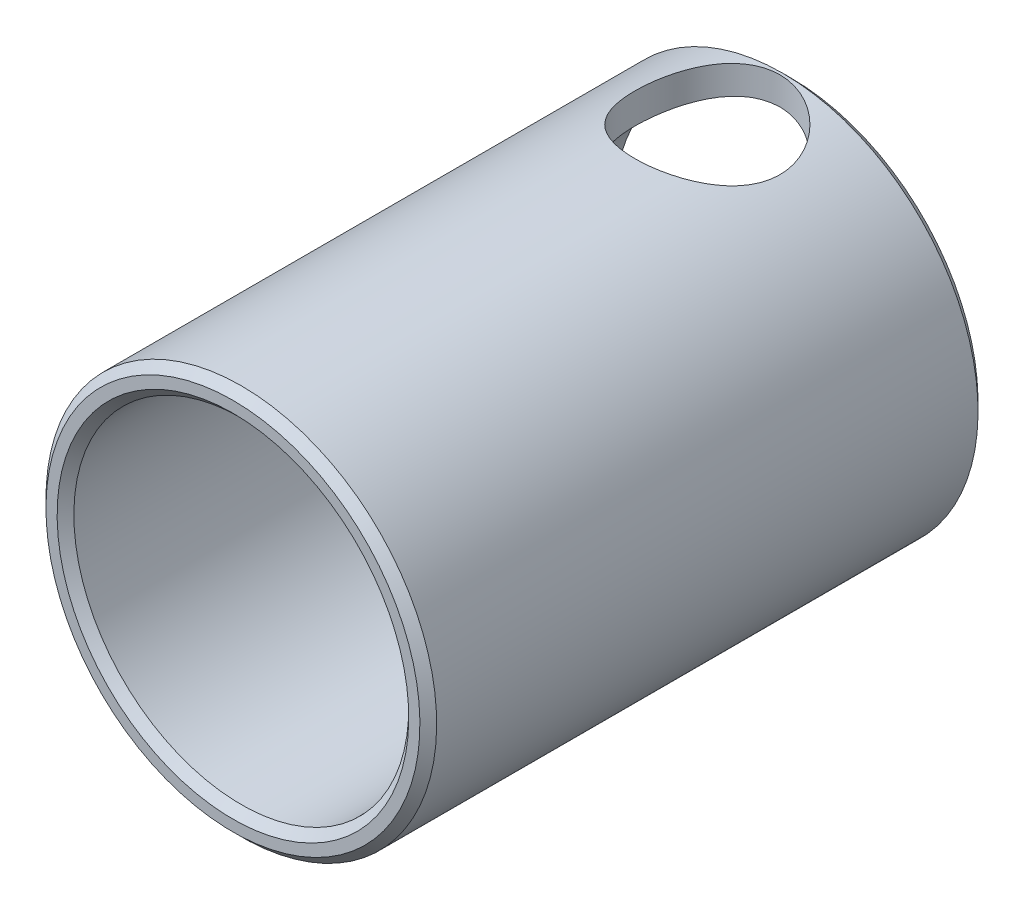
ISO-10303-21;
HEADER;
FILE_DESCRIPTION(('STEP AP214'),'2;1');
FILE_NAME('part.step','',(''),(''),'','','');
FILE_SCHEMA(('AUTOMOTIVE_DESIGN { 1 0 10303 214 1 1 1 1 }'));
ENDSEC;
DATA;
#1=APPLICATION_CONTEXT('core data for automotive mechanical design processes');
#2=APPLICATION_PROTOCOL_DEFINITION('international standard','automotive_design',2000,#1);
#3=PRODUCT_CONTEXT('',#1,'mechanical');
#4=PRODUCT('Part','Part','',(#3));
#5=PRODUCT_RELATED_PRODUCT_CATEGORY('part','',(#4));
#6=PRODUCT_DEFINITION_FORMATION('','',#4);
#7=PRODUCT_DEFINITION_CONTEXT('part definition',#1,'design');
#8=PRODUCT_DEFINITION('design','',#6,#7);
#9=PRODUCT_DEFINITION_SHAPE('','',#8);
#10=(LENGTH_UNIT() NAMED_UNIT(*) SI_UNIT(.MILLI.,.METRE.));
#11=(NAMED_UNIT(*) PLANE_ANGLE_UNIT() SI_UNIT($,.RADIAN.));
#12=(NAMED_UNIT(*) SI_UNIT($,.STERADIAN.) SOLID_ANGLE_UNIT());
#13=UNCERTAINTY_MEASURE_WITH_UNIT(LENGTH_MEASURE(1.E-05),#10,'distance_accuracy_value','');
#14=(GEOMETRIC_REPRESENTATION_CONTEXT(3) GLOBAL_UNCERTAINTY_ASSIGNED_CONTEXT((#13)) GLOBAL_UNIT_ASSIGNED_CONTEXT((#10,
#11,#12)) REPRESENTATION_CONTEXT('',''));
#15=CARTESIAN_POINT('',(0.,0.,0.));
#16=DIRECTION('',(0.,0.,1.));
#17=DIRECTION('',(1.,0.,0.));
#18=AXIS2_PLACEMENT_3D('',#15,#16,#17);
#19=CARTESIAN_POINT('',(0.,0.,20.));
#20=DIRECTION('',(0.,0.,-1.));
#21=DIRECTION('',(-1.,0.,0.));
#22=AXIS2_PLACEMENT_3D('',#19,#20,#21);
#23=CYLINDRICAL_SURFACE('',#22,7.);
#24=CARTESIAN_POINT('',(0.,0.,0.299999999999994));
#25=DIRECTION('',(0.,0.,1.));
#26=DIRECTION('',(0.,1.,0.));
#27=AXIS2_PLACEMENT_3D('',#24,#25,#26);
#28=CIRCLE('',#27,7.);
#29=CARTESIAN_POINT('',(0.,7.,0.299999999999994));
#30=VERTEX_POINT('',#29);
#31=EDGE_CURVE('E8',#30,#30,#28,.T.);
#32=ORIENTED_EDGE('',*,*,#31,.T.);
#33=EDGE_LOOP('',(#32));
#34=FACE_BOUND('',#33,.T.);
#35=CARTESIAN_POINT('',(0.,0.,19.7));
#36=DIRECTION('',(0.,0.,1.));
#37=DIRECTION('',(0.,1.,0.));
#38=AXIS2_PLACEMENT_3D('',#35,#36,#37);
#39=CIRCLE('',#38,7.);
#40=CARTESIAN_POINT('',(0.,7.,19.7));
#41=VERTEX_POINT('',#40);
#42=EDGE_CURVE('E35',#41,#41,#39,.F.);
#43=ORIENTED_EDGE('',*,*,#42,.T.);
#44=EDGE_LOOP('',(#43));
#45=FACE_BOUND('',#44,.T.);
#46=CARTESIAN_POINT('',(0.,7.,0.4));
#47=CARTESIAN_POINT('',(0.140902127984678,7.00000340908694,0.399995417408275));
#48=CARTESIAN_POINT('',(0.281772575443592,6.99570847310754,0.411489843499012));
#49=CARTESIAN_POINT('',(0.559308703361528,6.97900377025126,0.456981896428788));
#50=CARTESIAN_POINT('',(0.69597489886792,6.96659500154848,0.490976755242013));
#51=CARTESIAN_POINT('',(0.961060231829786,6.93499607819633,0.580105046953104));
#52=CARTESIAN_POINT('',(1.08949454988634,6.9158188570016,0.635198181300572));
#53=CARTESIAN_POINT('',(1.33529005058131,6.87259728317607,0.764756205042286));
#54=CARTESIAN_POINT('',(1.45264831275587,6.84855165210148,0.839226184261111));
#55=CARTESIAN_POINT('',(1.67786429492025,6.79695712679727,1.00867578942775));
#56=CARTESIAN_POINT('',(1.78519764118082,6.76931039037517,1.10432230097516));
#57=CARTESIAN_POINT('',(1.98272113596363,6.71411603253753,1.31199410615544));
#58=CARTESIAN_POINT('',(2.07290618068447,6.68656844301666,1.42402425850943));
#59=CARTESIAN_POINT('',(2.23687620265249,6.63355869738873,1.66637033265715));
#60=CARTESIAN_POINT('',(2.309925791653,6.6082123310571,1.79721167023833));
#61=CARTESIAN_POINT('',(2.43275023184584,6.56399417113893,2.07041309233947));
#62=CARTESIAN_POINT('',(2.48253417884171,6.54511984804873,2.21276864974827));
#63=CARTESIAN_POINT('',(2.5553531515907,6.51702746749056,2.49892679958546));
#64=CARTESIAN_POINT('',(2.57938744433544,6.50745015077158,2.64243866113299));
#65=CARTESIAN_POINT('',(2.60314935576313,6.49798380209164,2.93175348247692));
#66=CARTESIAN_POINT('',(2.60288677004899,6.49809086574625,3.07755549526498));
#67=CARTESIAN_POINT('',(2.57882752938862,6.50767095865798,3.35822753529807));
#68=CARTESIAN_POINT('',(2.55640932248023,6.51659539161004,3.49323790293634));
#69=CARTESIAN_POINT('',(2.49095130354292,6.54189421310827,3.75742220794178));
#70=CARTESIAN_POINT('',(2.44790844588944,6.55826970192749,3.88659528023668));
#71=CARTESIAN_POINT('',(2.34165335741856,6.59696112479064,4.13827617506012));
#72=CARTESIAN_POINT('',(2.27807915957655,6.61938237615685,4.26061427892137));
#73=CARTESIAN_POINT('',(2.13281821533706,6.6676031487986,4.49328919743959));
#74=CARTESIAN_POINT('',(2.05112529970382,6.69340381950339,4.60362190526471));
#75=CARTESIAN_POINT('',(1.86561162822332,6.74754880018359,4.81679505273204));
#76=CARTESIAN_POINT('',(1.76068817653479,6.7759487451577,4.9186640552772));
#77=CARTESIAN_POINT('',(1.5349179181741,6.83062982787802,5.10364628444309));
#78=CARTESIAN_POINT('',(1.41406876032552,6.8569106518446,5.18675673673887));
#79=CARTESIAN_POINT('',(1.15743751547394,6.90489731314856,5.3329069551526));
#80=CARTESIAN_POINT('',(1.02145960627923,6.92652907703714,5.39562891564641));
#81=CARTESIAN_POINT('',(0.739879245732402,6.96223204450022,5.49698648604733));
#82=CARTESIAN_POINT('',(0.594281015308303,6.9763065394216,5.5356325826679));
#83=CARTESIAN_POINT('',(0.305773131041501,6.99473357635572,5.58588709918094));
#84=CARTESIAN_POINT('',(0.163121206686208,6.99955613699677,5.59880404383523));
#85=CARTESIAN_POINT('',(-0.122376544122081,7.00038457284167,5.60103632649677));
#86=CARTESIAN_POINT('',(-0.265222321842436,6.99639235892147,5.59035677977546));
#87=CARTESIAN_POINT('',(-0.541435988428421,6.98035004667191,5.54669781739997));
#88=CARTESIAN_POINT('',(-0.674958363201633,6.96860812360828,5.51457074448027));
#89=CARTESIAN_POINT('',(-0.934627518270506,6.93855669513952,5.43004585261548));
#90=CARTESIAN_POINT('',(-1.06077333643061,6.92024633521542,5.37764539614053));
#91=CARTESIAN_POINT('',(-1.30622972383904,6.87820684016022,5.25239914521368));
#92=CARTESIAN_POINT('',(-1.42523360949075,6.85433523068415,5.17900159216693));
#93=CARTESIAN_POINT('',(-1.64963112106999,6.80382009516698,5.01447034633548));
#94=CARTESIAN_POINT('',(-1.75501976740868,6.77717556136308,4.9233301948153));
#95=CARTESIAN_POINT('',(-1.95546470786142,6.72217031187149,4.71979576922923));
#96=CARTESIAN_POINT('',(-2.04959193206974,6.69379820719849,4.60648723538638));
#97=CARTESIAN_POINT('',(-2.21767356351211,6.64001014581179,4.36511926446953));
#98=CARTESIAN_POINT('',(-2.29162634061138,6.61459442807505,4.23705863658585));
#99=CARTESIAN_POINT('',(-2.41728845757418,6.56971904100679,3.96887010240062));
#100=CARTESIAN_POINT('',(-2.46891958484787,6.55028038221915,3.82870179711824));
#101=CARTESIAN_POINT('',(-2.54751642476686,6.52012013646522,3.54073962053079));
#102=CARTESIAN_POINT('',(-2.57449700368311,6.50939329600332,3.39295040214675));
#103=CARTESIAN_POINT('',(-2.60171215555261,6.49856044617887,3.10398712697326));
#104=CARTESIAN_POINT('',(-2.60352712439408,6.49782691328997,2.96298416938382));
#105=CARTESIAN_POINT('',(-2.58439424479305,6.50546005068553,2.68279574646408));
#106=CARTESIAN_POINT('',(-2.56344847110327,6.51382589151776,2.54361011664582));
#107=CARTESIAN_POINT('',(-2.50061005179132,6.53819746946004,2.27515018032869));
#108=CARTESIAN_POINT('',(-2.45935063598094,6.55397162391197,2.14570484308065));
#109=CARTESIAN_POINT('',(-2.35760940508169,6.59125168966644,1.8954955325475));
#110=CARTESIAN_POINT('',(-2.29712277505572,6.61275903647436,1.77473374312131));
#111=CARTESIAN_POINT('',(-2.15501364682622,6.66046565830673,1.53853411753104));
#112=CARTESIAN_POINT('',(-2.07246017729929,6.68685000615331,1.42369421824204));
#113=CARTESIAN_POINT('',(-1.89001350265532,6.74068894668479,1.20899196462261));
#114=CARTESIAN_POINT('',(-1.7901148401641,6.76814387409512,1.10913434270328));
#115=CARTESIAN_POINT('',(-1.5695204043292,6.82276788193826,0.921872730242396));
#116=CARTESIAN_POINT('',(-1.44800627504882,6.84984571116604,0.835401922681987));
#117=CARTESIAN_POINT('',(-1.19122351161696,6.899134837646,0.684144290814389));
#118=CARTESIAN_POINT('',(-1.0559542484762,6.92134591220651,0.619358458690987));
#119=CARTESIAN_POINT('',(-0.770373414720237,6.95901970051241,0.511909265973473));
#120=CARTESIAN_POINT('',(-0.619699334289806,6.97421640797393,0.470107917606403));
#121=CARTESIAN_POINT('',(-0.312668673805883,6.99470230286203,0.414162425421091));
#122=CARTESIAN_POINT('',(-0.156314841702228,6.99999621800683,0.400005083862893));
#123=CARTESIAN_POINT('',(0.,7.,0.4));
#124=B_SPLINE_CURVE_WITH_KNOTS('',3,(#46,#47,#48,#49,#50,#51,#52,#53,#54,#55,#56,#57,#58,#59,
#60,#61,#62,#63,#64,#65,#66,#67,#68,#69,#70,#71,#72,#73,#74,#75,#76,#77,#78,#79,#80,#81,#82,#83,
#84,#85,#86,#87,#88,#89,#90,#91,#92,#93,#94,#95,#96,#97,#98,#99,#100,#101,#102,#103,#104,#105,
#106,#107,#108,#109,#110,#111,#112,#113,#114,#115,#116,#117,#118,#119,#120,#121,#122,#123),
.UNSPECIFIED.,.T.,.F.,(4,2,2,2,2,2,2,2,2,2,2,2,2,2,2,2,2,2,2,2,2,2,2,2,2,2,2,2,2,2,2,2,2,2,2,2,
2,2,4),(0.,0.42212993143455,0.844207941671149,1.26548375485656,1.68687033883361,
2.12412948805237,2.56151857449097,3.01518807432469,3.46868006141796,3.90385364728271,
4.33885178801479,4.74838765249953,5.15798401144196,5.57523654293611,5.99263136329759,
6.43750488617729,6.88244416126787,7.33401897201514,7.78539695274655,8.213164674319,
8.64083967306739,9.05245687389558,9.46412764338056,9.88780578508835,10.3116384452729,
10.7595862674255,11.2075702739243,11.6571114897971,12.1063814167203,12.5272995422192,
12.9481793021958,13.3566987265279,13.7653205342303,14.1950659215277,14.6249467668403,
15.0774737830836,15.5300215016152,15.9985502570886,16.4668552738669),.UNSPECIFIED.);
#125=CARTESIAN_POINT('',(0.,7.,0.4));
#126=VERTEX_POINT('',#125);
#127=EDGE_CURVE('E52',#126,#126,#124,.T.);
#128=ORIENTED_EDGE('',*,*,#127,.T.);
#129=EDGE_LOOP('',(#128));
#130=FACE_BOUND('',#129,.T.);
#131=ADVANCED_FACE('F12',(#34,#45,#130),#23,.T.);
#132=CARTESIAN_POINT('',(0.,0.,20.));
#133=DIRECTION('',(0.,0.,-1.));
#134=DIRECTION('',(-1.,0.,0.));
#135=AXIS2_PLACEMENT_3D('',#132,#133,#134);
#136=CYLINDRICAL_SURFACE('',#135,6.);
#137=CARTESIAN_POINT('',(0.,0.,0.300000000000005));
#138=DIRECTION('',(0.,0.,1.));
#139=DIRECTION('',(0.,1.,0.));
#140=AXIS2_PLACEMENT_3D('',#137,#138,#139);
#141=CIRCLE('',#140,6.);
#142=CARTESIAN_POINT('',(0.,6.,0.300000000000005));
#143=VERTEX_POINT('',#142);
#144=EDGE_CURVE('E19',#143,#143,#141,.F.);
#145=ORIENTED_EDGE('',*,*,#144,.T.);
#146=EDGE_LOOP('',(#145));
#147=FACE_BOUND('',#146,.T.);
#148=CARTESIAN_POINT('',(0.,0.,19.7));
#149=DIRECTION('',(0.,0.,1.));
#150=DIRECTION('',(0.,1.,0.));
#151=AXIS2_PLACEMENT_3D('',#148,#149,#150);
#152=CIRCLE('',#151,6.);
#153=CARTESIAN_POINT('',(0.,6.,19.7));
#154=VERTEX_POINT('',#153);
#155=EDGE_CURVE('E32',#154,#154,#152,.T.);
#156=ORIENTED_EDGE('',*,*,#155,.T.);
#157=EDGE_LOOP('',(#156));
#158=FACE_BOUND('',#157,.T.);
#159=CARTESIAN_POINT('',(0.,6.,0.4));
#160=CARTESIAN_POINT('',(-0.138770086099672,5.99999464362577,0.400006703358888));
#161=CARTESIAN_POINT('',(-0.277770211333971,5.99513125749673,0.411175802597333));
#162=CARTESIAN_POINT('',(-0.551789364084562,5.97616070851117,0.455420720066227));
#163=CARTESIAN_POINT('',(-0.686797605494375,5.96203053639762,0.488551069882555));
#164=CARTESIAN_POINT('',(-0.94843727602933,5.92603100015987,0.575255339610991));
#165=CARTESIAN_POINT('',(-1.07509620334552,5.90418872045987,0.628757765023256));
#166=CARTESIAN_POINT('',(-1.31750805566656,5.85486927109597,0.754376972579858));
#167=CARTESIAN_POINT('',(-1.43326378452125,5.82739355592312,0.826488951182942));
#168=CARTESIAN_POINT('',(-1.65695907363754,5.76788796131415,0.991338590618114));
#169=CARTESIAN_POINT('',(-1.76424103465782,5.73570122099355,1.0849114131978));
#170=CARTESIAN_POINT('',(-1.96216325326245,5.67104726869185,1.28825648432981));
#171=CARTESIAN_POINT('',(-2.05279407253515,5.63857990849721,1.39803785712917));
#172=CARTESIAN_POINT('',(-2.21971183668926,5.57505985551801,1.63788529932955));
#173=CARTESIAN_POINT('',(-2.29495471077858,5.54417929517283,1.76872843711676));
#174=CARTESIAN_POINT('',(-2.42207039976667,5.48984418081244,2.04273914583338));
#175=CARTESIAN_POINT('',(-2.473956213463,5.46638549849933,2.18589980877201));
#176=CARTESIAN_POINT('',(-2.55011381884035,5.43126208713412,2.47291368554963));
#177=CARTESIAN_POINT('',(-2.57565631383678,5.41905800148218,2.61636103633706));
#178=CARTESIAN_POINT('',(-2.60235934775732,5.40628974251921,2.90598443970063));
#179=CARTESIAN_POINT('',(-2.60353496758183,5.40571836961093,3.05215874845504));
#180=CARTESIAN_POINT('',(-2.58242228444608,5.41582747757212,3.32993082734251));
#181=CARTESIAN_POINT('',(-2.56210134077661,5.42556458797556,3.46171960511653));
#182=CARTESIAN_POINT('',(-2.50189269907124,5.45358815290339,3.71978975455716));
#183=CARTESIAN_POINT('',(-2.46200088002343,5.47187640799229,3.84606996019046));
#184=CARTESIAN_POINT('',(-2.36299467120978,5.51536248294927,4.09285416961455));
#185=CARTESIAN_POINT('',(-2.30347621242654,5.54070362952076,4.21316966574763));
#186=CARTESIAN_POINT('',(-2.16719462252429,5.59541339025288,4.4425980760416));
#187=CARTESIAN_POINT('',(-2.09042440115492,5.62478365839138,4.55170635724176));
#188=CARTESIAN_POINT('',(-1.91352700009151,5.68752991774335,4.76620292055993));
#189=CARTESIAN_POINT('',(-1.81189968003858,5.72102568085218,4.87032267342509));
#190=CARTESIAN_POINT('',(-1.59232356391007,5.78598366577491,5.06048692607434));
#191=CARTESIAN_POINT('',(-1.47437031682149,5.81744532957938,5.14652648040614));
#192=CARTESIAN_POINT('',(-1.22136681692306,5.87584384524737,5.30015945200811));
#193=CARTESIAN_POINT('',(-1.08594295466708,5.90263676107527,5.36719644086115));
#194=CARTESIAN_POINT('',(-0.804281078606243,5.9475553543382,5.47708401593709));
#195=CARTESIAN_POINT('',(-0.658049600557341,5.96568622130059,5.51994908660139));
#196=CARTESIAN_POINT('',(-0.369489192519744,5.99024386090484,5.57752755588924));
#197=CARTESIAN_POINT('',(-0.227559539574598,5.99737596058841,5.59394083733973));
#198=CARTESIAN_POINT('',(0.0571955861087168,6.00141465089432,5.6032676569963));
#199=CARTESIAN_POINT('',(0.200020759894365,5.99832448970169,5.5961886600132));
#200=CARTESIAN_POINT('',(0.474283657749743,5.98271758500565,5.55991177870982));
#201=CARTESIAN_POINT('',(0.605917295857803,5.97072487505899,5.53194299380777));
#202=CARTESIAN_POINT('',(0.862457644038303,5.93909775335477,5.45643099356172));
#203=CARTESIAN_POINT('',(0.987363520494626,5.91946239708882,5.40888535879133));
#204=CARTESIAN_POINT('',(1.23132425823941,5.87364744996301,5.29403311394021));
#205=CARTESIAN_POINT('',(1.35007431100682,5.84728253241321,5.22615542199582));
#206=CARTESIAN_POINT('',(1.57492719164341,5.79077427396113,5.07318943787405));
#207=CARTESIAN_POINT('',(1.68102455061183,5.76062931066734,4.98809374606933));
#208=CARTESIAN_POINT('',(1.88615702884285,5.6969131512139,4.79546591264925));
#209=CARTESIAN_POINT('',(1.98402056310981,5.66325679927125,4.68671119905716));
#210=CARTESIAN_POINT('',(2.16047492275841,5.59832200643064,4.45385517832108));
#211=CARTESIAN_POINT('',(2.23905996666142,5.56704428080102,4.32974928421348));
#212=CARTESIAN_POINT('',(2.37598793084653,5.51001922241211,4.06636017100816));
#213=CARTESIAN_POINT('',(2.4339054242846,5.4843918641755,3.92682782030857));
#214=CARTESIAN_POINT('',(2.52489287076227,5.44311102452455,3.63852183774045));
#215=CARTESIAN_POINT('',(2.55798558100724,5.4274484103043,3.48975680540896));
#216=CARTESIAN_POINT('',(2.59603826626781,5.40934272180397,3.20030940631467));
#217=CARTESIAN_POINT('',(2.60307711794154,5.40592353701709,3.05996062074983));
#218=CARTESIAN_POINT('',(2.59446390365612,5.4100631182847,2.78014149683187));
#219=CARTESIAN_POINT('',(2.57881607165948,5.41761983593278,2.64067099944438));
#220=CARTESIAN_POINT('',(2.52706522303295,5.44193735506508,2.37442743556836));
#221=CARTESIAN_POINT('',(2.4921216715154,5.4581749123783,2.24737641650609));
#222=CARTESIAN_POINT('',(2.40395776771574,5.49757271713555,2.00093693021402));
#223=CARTESIAN_POINT('',(2.35073219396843,5.52073494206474,1.88155066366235));
#224=CARTESIAN_POINT('',(2.22368900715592,5.57316816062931,1.64564985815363));
#225=CARTESIAN_POINT('',(2.14879029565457,5.60273093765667,1.52978372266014));
#226=CARTESIAN_POINT('',(1.98197805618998,5.66389024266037,1.31161645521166));
#227=CARTESIAN_POINT('',(1.89005788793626,5.69548756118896,1.20932064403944));
#228=CARTESIAN_POINT('',(1.6829365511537,5.76024368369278,1.01260672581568));
#229=CARTESIAN_POINT('',(1.56644918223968,5.79332014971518,0.919508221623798));
#230=CARTESIAN_POINT('',(1.31835423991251,5.85476592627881,0.754071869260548));
#231=CARTESIAN_POINT('',(1.18673984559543,5.88313309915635,0.681743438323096));
#232=CARTESIAN_POINT('',(0.913505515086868,5.93164474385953,0.561264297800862));
#233=CARTESIAN_POINT('',(0.772047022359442,5.95189635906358,0.512796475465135));
#234=CARTESIAN_POINT('',(0.554803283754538,5.97474145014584,0.458784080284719));
#235=CARTESIAN_POINT('',(0.481609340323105,5.98109891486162,0.443899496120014));
#236=CARTESIAN_POINT('',(0.334049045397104,5.99114821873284,0.420469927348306));
#237=CARTESIAN_POINT('',(0.25968356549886,5.99484195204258,0.411920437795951));
#238=CARTESIAN_POINT('',(0.154286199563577,5.99809529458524,0.404397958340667));
#239=CARTESIAN_POINT('',(0.12345729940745,5.99880881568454,0.402749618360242));
#240=CARTESIAN_POINT('',(0.061756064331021,5.9997617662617,0.400549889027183));
#241=CARTESIAN_POINT('',(0.0308837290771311,6.00000119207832,0.399998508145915));
#242=CARTESIAN_POINT('',(0.,6.,0.4));
#243=B_SPLINE_CURVE_WITH_KNOTS('',3,(#159,#160,#161,#162,#163,#164,#165,#166,#167,#168,#169,
#170,#171,#172,#173,#174,#175,#176,#177,#178,#179,#180,#181,#182,#183,#184,#185,#186,#187,#188,
#189,#190,#191,#192,#193,#194,#195,#196,#197,#198,#199,#200,#201,#202,#203,#204,#205,#206,#207,
#208,#209,#210,#211,#212,#213,#214,#215,#216,#217,#218,#219,#220,#221,#222,#223,#224,#225,#226,
#227,#228,#229,#230,#231,#232,#233,#234,#235,#236,#237,#238,#239,#240,#241,#242),.UNSPECIFIED.,
.T.,.F.,(4,2,2,2,2,2,2,2,2,2,2,2,2,2,2,2,2,2,2,2,2,2,2,2,2,2,2,2,2,2,2,2,2,2,2,2,2,2,2,2,2,4),
(0.,0.416189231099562,0.833415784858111,1.24919140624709,1.66485981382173,2.10082381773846,
2.5370341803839,2.99689422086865,3.45649802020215,3.89271671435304,4.32866542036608,
4.72790665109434,5.12723198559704,5.53535345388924,5.94364296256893,6.38954306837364,
6.835564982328,7.29354560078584,7.75125149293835,8.17816556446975,8.60494399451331,
9.00841464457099,9.41193517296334,9.82806530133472,10.2443746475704,10.6927174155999,
11.1411944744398,11.5984326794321,12.0552512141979,12.4747210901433,12.8941126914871,
13.2906819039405,13.6873644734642,14.1088968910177,14.5305941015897,14.9866269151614,
15.4428661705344,15.8928661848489,16.1174908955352,16.3419557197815,16.4345792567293,
16.5272035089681),.UNSPECIFIED.);
#244=CARTESIAN_POINT('',(0.,6.,0.4));
#245=VERTEX_POINT('',#244);
#246=EDGE_CURVE('E44',#245,#245,#243,.T.);
#247=ORIENTED_EDGE('',*,*,#246,.T.);
#248=EDGE_LOOP('',(#247));
#249=FACE_BOUND('',#248,.T.);
#250=ADVANCED_FACE('F57',(#147,#158,#249),#136,.F.);
#251=CARTESIAN_POINT('',(0.,0.,20.));
#252=DIRECTION('',(0.,0.,1.));
#253=DIRECTION('',(1.,0.,0.));
#254=AXIS2_PLACEMENT_3D('',#251,#252,#253);
#255=PLANE('',#254);
#256=CARTESIAN_POINT('',(0.,0.,20.));
#257=DIRECTION('',(0.,0.,1.));
#258=DIRECTION('',(0.,1.,0.));
#259=AXIS2_PLACEMENT_3D('',#256,#257,#258);
#260=CIRCLE('',#259,6.7);
#261=CARTESIAN_POINT('',(0.,6.7,20.));
#262=VERTEX_POINT('',#261);
#263=EDGE_CURVE('E38',#262,#262,#260,.T.);
#264=ORIENTED_EDGE('',*,*,#263,.T.);
#265=EDGE_LOOP('',(#264));
#266=FACE_BOUND('',#265,.T.);
#267=CARTESIAN_POINT('',(0.,0.,20.));
#268=DIRECTION('',(0.,0.,1.));
#269=DIRECTION('',(0.,1.,0.));
#270=AXIS2_PLACEMENT_3D('',#267,#268,#269);
#271=CIRCLE('',#270,6.3);
#272=CARTESIAN_POINT('',(0.,6.3,20.));
#273=VERTEX_POINT('',#272);
#274=EDGE_CURVE('E41',#273,#273,#271,.F.);
#275=ORIENTED_EDGE('',*,*,#274,.T.);
#276=EDGE_LOOP('',(#275));
#277=FACE_BOUND('',#276,.T.);
#278=ADVANCED_FACE('F77',(#266,#277),#255,.T.);
#279=CARTESIAN_POINT('',(0.,0.,0.));
#280=DIRECTION('',(0.,0.,1.));
#281=DIRECTION('',(1.,0.,0.));
#282=AXIS2_PLACEMENT_3D('',#279,#280,#281);
#283=PLANE('',#282);
#284=CARTESIAN_POINT('',(0.,0.,0.));
#285=DIRECTION('',(0.,0.,1.));
#286=DIRECTION('',(0.,1.,0.));
#287=AXIS2_PLACEMENT_3D('',#284,#285,#286);
#288=CIRCLE('',#287,6.3);
#289=CARTESIAN_POINT('',(0.,6.3,0.));
#290=VERTEX_POINT('',#289);
#291=EDGE_CURVE('E23',#290,#290,#288,.T.);
#292=ORIENTED_EDGE('',*,*,#291,.T.);
#293=EDGE_LOOP('',(#292));
#294=FACE_BOUND('',#293,.T.);
#295=CARTESIAN_POINT('',(0.,0.,0.));
#296=DIRECTION('',(0.,0.,1.));
#297=DIRECTION('',(0.,1.,0.));
#298=AXIS2_PLACEMENT_3D('',#295,#296,#297);
#299=CIRCLE('',#298,6.7);
#300=CARTESIAN_POINT('',(0.,6.7,0.));
#301=VERTEX_POINT('',#300);
#302=EDGE_CURVE('E27',#301,#301,#299,.F.);
#303=ORIENTED_EDGE('',*,*,#302,.T.);
#304=EDGE_LOOP('',(#303));
#305=FACE_BOUND('',#304,.T.);
#306=ADVANCED_FACE('F64',(#294,#305),#283,.F.);
#307=CARTESIAN_POINT('',(0.,7.001,3.));
#308=DIRECTION('',(0.,-1.,0.));
#309=DIRECTION('',(0.,0.,-1.));
#310=AXIS2_PLACEMENT_3D('',#307,#308,#309);
#311=CYLINDRICAL_SURFACE('',#310,2.6);
#312=ORIENTED_EDGE('',*,*,#246,.F.);
#313=EDGE_LOOP('',(#312));
#314=FACE_BOUND('',#313,.T.);
#315=ORIENTED_EDGE('',*,*,#127,.F.);
#316=EDGE_LOOP('',(#315));
#317=FACE_BOUND('',#316,.T.);
#318=ADVANCED_FACE('F60',(#314,#317),#311,.F.);
#319=CARTESIAN_POINT('',(0.,0.,20.));
#320=DIRECTION('',(0.,0.,-1.));
#321=DIRECTION('',(0.,-1.,0.));
#322=AXIS2_PLACEMENT_3D('',#319,#320,#321);
#323=CONICAL_SURFACE('',#322,6.7,0.785398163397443);
#324=ORIENTED_EDGE('',*,*,#42,.F.);
#325=EDGE_LOOP('',(#324));
#326=FACE_BOUND('',#325,.T.);
#327=ORIENTED_EDGE('',*,*,#263,.F.);
#328=EDGE_LOOP('',(#327));
#329=FACE_BOUND('',#328,.T.);
#330=ADVANCED_FACE('F63',(#326,#329),#323,.T.);
#331=CARTESIAN_POINT('',(0.,0.,19.7));
#332=DIRECTION('',(0.,0.,1.));
#333=DIRECTION('',(0.,1.,0.));
#334=AXIS2_PLACEMENT_3D('',#331,#332,#333);
#335=CONICAL_SURFACE('',#334,6.,0.785398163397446);
#336=ORIENTED_EDGE('',*,*,#274,.F.);
#337=EDGE_LOOP('',(#336));
#338=FACE_BOUND('',#337,.T.);
#339=ORIENTED_EDGE('',*,*,#155,.F.);
#340=EDGE_LOOP('',(#339));
#341=FACE_BOUND('',#340,.T.);
#342=ADVANCED_FACE('F74',(#338,#341),#335,.F.);
#343=CARTESIAN_POINT('',(0.,0.,0.));
#344=DIRECTION('',(0.,0.,-1.));
#345=DIRECTION('',(0.,-1.,0.));
#346=AXIS2_PLACEMENT_3D('',#343,#344,#345);
#347=CONICAL_SURFACE('',#346,6.3,0.785398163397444);
#348=ORIENTED_EDGE('',*,*,#144,.F.);
#349=EDGE_LOOP('',(#348));
#350=FACE_BOUND('',#349,.T.);
#351=ORIENTED_EDGE('',*,*,#291,.F.);
#352=EDGE_LOOP('',(#351));
#353=FACE_BOUND('',#352,.T.);
#354=ADVANCED_FACE('F91',(#350,#353),#347,.F.);
#355=CARTESIAN_POINT('',(0.,0.,0.299999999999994));
#356=DIRECTION('',(0.,0.,1.));
#357=DIRECTION('',(0.,1.,0.));
#358=AXIS2_PLACEMENT_3D('',#355,#356,#357);
#359=CONICAL_SURFACE('',#358,7.,0.78539816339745);
#360=ORIENTED_EDGE('',*,*,#302,.F.);
#361=EDGE_LOOP('',(#360));
#362=FACE_BOUND('',#361,.T.);
#363=ORIENTED_EDGE('',*,*,#31,.F.);
#364=EDGE_LOOP('',(#363));
#365=FACE_BOUND('',#364,.T.);
#366=ADVANCED_FACE('F14',(#362,#365),#359,.T.);
#367=CLOSED_SHELL('',(#131,#250,#278,#306,#318,#330,#342,#354,#366));
#368=MANIFOLD_SOLID_BREP('B1',#367);
#369=ADVANCED_BREP_SHAPE_REPRESENTATION('',(#18,#368),#14);
#370=SHAPE_DEFINITION_REPRESENTATION(#9,#369);
ENDSEC;
END-ISO-10303-21;
